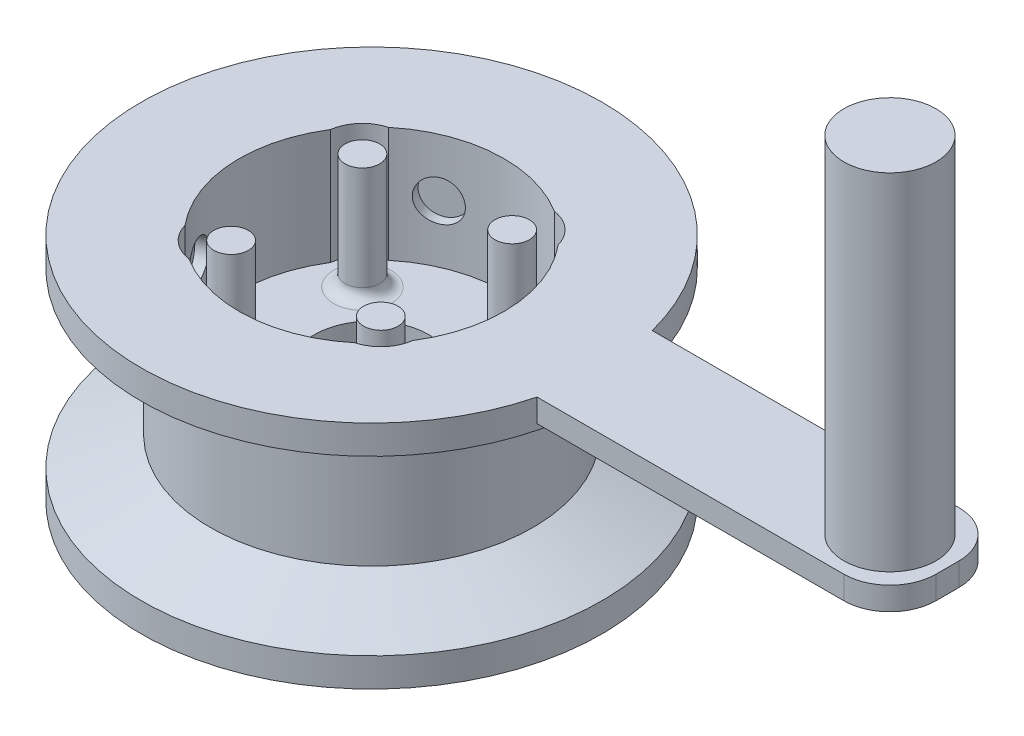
from build123d import *

# Parameters (mm, degrees)
SKETCH2_R           = 29.21
SKETCH2_R_2         = 12.7
BOSS_EXTRUDE1_DEPTH = 25.4
SKETCH3_R           = 3.81
BOSS_EXTRUDE2_DEPTH = 25.4
CIRPATTERN1_COUNT   = 4
BOSS_EXTRUDE3_DEPTH = 5.08
SKETCH5_R           = 10.16
BOSS_EXTRUDE4_DEPTH = 76.2
FILLET1_R           = 2.54
SKETCH10_R          = 4.445
CUT_EXTRUDE3_DEPTH  = 6.35
CIRPATTERN2_COUNT   = 4
CUT_EXTRUDE4_START  = -25.4
CUT_EXTRUDE4_DEPTH  = 25.4
CIRPATTERN3_COUNT   = 4


with BuildPart() as part:
    # Sketch1 → Revolve1 (revolve)
    with BuildSketch(Plane(origin=(0, 0, 0), x_dir=(0, 0, -1), z_dir=(1, 0, 0)), mode=Mode.PRIVATE) as revolve1_sk:
        Polygon((-29.21, 0), (-50.8, 0), (-50.8, 6.35), (-35.56, 12.7), (-35.56, 38.1), (-50.8, 44.45), (-50.8, 50.8), (-29.21, 50.8), align=None)
    revolve(revolve1_sk.sketch.rotate(Axis((0, 0, 0), (0, 1, 0)), 180), axis=Axis((0, 0, 0), (0, 1, 0)))

    # Sketch2 → Boss-Extrude1 (add)
    with BuildSketch(Plane(origin=(0, 0, 0), x_dir=(-1, 0, 0), z_dir=(0, -1, 0))):
        with Locations(Location((0, 0, 0), (0, 0, 90))):
            Circle(SKETCH2_R)
        with Locations(Location((0, 0, 0), (0, 0, 90))):
            Circle(SKETCH2_R_2, mode=Mode.SUBTRACT)
    extrude(amount=-BOSS_EXTRUDE1_DEPTH)

    # Sketch3 → Boss-Extrude2 (add)
    with BuildSketch(Plane(origin=(0, 25.4, 0), x_dir=(1, 0, 0), z_dir=(0, 1, 0))):
        with Locations(Location((-16.51, 14.478, 0), (0, 0, 90))):
            Circle(SKETCH3_R)
    boss_extrude2 = extrude(amount=BOSS_EXTRUDE2_DEPTH)

    # CirPattern1: Boss-Extrude2 ×4 about axis
    cirpattern1_axis = Axis((0, 0, 0), (0, 1, 0))
    for i in range(1, CIRPATTERN1_COUNT):
        add(boss_extrude2.rotate(cirpattern1_axis, i * 360 / CIRPATTERN1_COUNT))

    # Sketch4 → Boss-Extrude3 (add)
    with BuildSketch(Plane(origin=(0, 50.8, 0), x_dir=(1, 0, 0), z_dir=(0, 1, 0))):
        with BuildLine():
            Line((31.75, 12.7), (116.84, 12.7))
            ThreePointArc((116.84, 12.7), (124.024204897, 9.724204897), (127, 2.54))
            Line((127, 2.54), (127, -2.54))
            ThreePointArc((127, -2.54), (124.024204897, -9.724204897), (116.84, -12.7))
            Line((116.84, -12.7), (31.75, -12.7))
            Line((31.75, -12.7), (31.75, 12.7))
        make_face()
    extrude(amount=-BOSS_EXTRUDE3_DEPTH)

    # Sketch5 → Boss-Extrude4 (add)
    with BuildSketch(Plane(origin=(0, 50.8, 0), x_dir=(1, 0, 0), z_dir=(0, 1, 0))):
        with Locations(Location((114.3, 0, 0), (0, 0, 90))):
            Circle(SKETCH5_R)
    extrude(amount=BOSS_EXTRUDE4_DEPTH)

    # Fillet1
    fillet1_edges = [part.edges().sort_by_distance(p)[0] for p in [
        (-16.51, 25.4, -10.668),
        (10.668, 25.4, -16.51),
        (16.51, 25.4, 10.668),
        (-10.668, 25.4, 16.51),
    ]]
    fillet(fillet1_edges, radius=FILLET1_R)

    # Sketch10 → Cut-Extrude3 (cut)
    with BuildSketch(Plane(origin=(-10.043960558, 0, -22.866603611), x_dir=(-0.9155708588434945, 0, 0.40215668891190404), z_dir=(-0.40215668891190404, 0, -0.9155708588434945))):
        with Locations(Location((0, 38.1, 0), (0, 0, 180))):
            Circle(SKETCH10_R)
    cut_extrude3 = extrude(amount=CUT_EXTRUDE3_DEPTH, mode=Mode.SUBTRACT)

    # CirPattern2: Cut-Extrude3 ×4 about axis
    cirpattern2_axis = Axis((0, 0, 0), (0, 1, 0))
    for i in range(1, CIRPATTERN2_COUNT):
        add(cut_extrude3.rotate(cirpattern2_axis, i * 360 / CIRPATTERN2_COUNT), mode=Mode.SUBTRACT)

    # Sketch11 → Cut-Extrude4 (cut)
    with BuildSketch(Plane(origin=(0, 50.8, 0), x_dir=(1, 0, 0), z_dir=(0, 1, 0)).offset(CUT_EXTRUDE4_START)):
        with BuildLine():
            ThreePointArc((-18.704231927, 22.436038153), (-22.716601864, 19.920712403), (-24.686429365, 15.614234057))
            ThreePointArc((-24.686429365, 15.614234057), (-21.961821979, 19.258828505), (-18.704231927, 22.436038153))
        make_face()
    cut_extrude4 = extrude(amount=CUT_EXTRUDE4_DEPTH, mode=Mode.SUBTRACT)

    # CirPattern3: Cut-Extrude4 ×4 about axis
    cirpattern3_axis = Axis((0, 0, 0), (0, 1, 0))
    for i in range(1, CIRPATTERN3_COUNT):
        add(cut_extrude4.rotate(cirpattern3_axis, i * 360 / CIRPATTERN3_COUNT), mode=Mode.SUBTRACT)


solid = part.part
